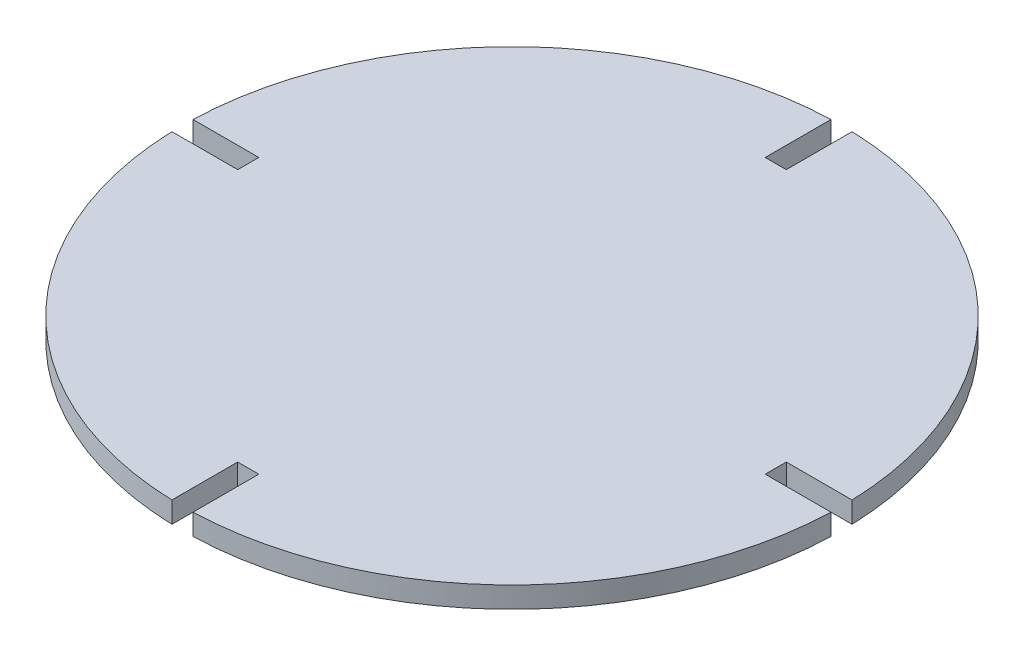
ISO-10303-21;
HEADER;
FILE_DESCRIPTION(('STEP AP214'),'2;1');
FILE_NAME('part.step','',(''),(''),'','','');
FILE_SCHEMA(('AUTOMOTIVE_DESIGN { 1 0 10303 214 1 1 1 1 }'));
ENDSEC;
DATA;
#1=APPLICATION_CONTEXT('core data for automotive mechanical design processes');
#2=APPLICATION_PROTOCOL_DEFINITION('international standard','automotive_design',2000,#1);
#3=PRODUCT_CONTEXT('',#1,'mechanical');
#4=PRODUCT('Part','Part','',(#3));
#5=PRODUCT_RELATED_PRODUCT_CATEGORY('part','',(#4));
#6=PRODUCT_DEFINITION_FORMATION('','',#4);
#7=PRODUCT_DEFINITION_CONTEXT('part definition',#1,'design');
#8=PRODUCT_DEFINITION('design','',#6,#7);
#9=PRODUCT_DEFINITION_SHAPE('','',#8);
#10=(LENGTH_UNIT() NAMED_UNIT(*) SI_UNIT(.MILLI.,.METRE.));
#11=(NAMED_UNIT(*) PLANE_ANGLE_UNIT() SI_UNIT($,.RADIAN.));
#12=(NAMED_UNIT(*) SI_UNIT($,.STERADIAN.) SOLID_ANGLE_UNIT());
#13=UNCERTAINTY_MEASURE_WITH_UNIT(LENGTH_MEASURE(1.E-05),#10,'distance_accuracy_value','');
#14=(GEOMETRIC_REPRESENTATION_CONTEXT(3) GLOBAL_UNCERTAINTY_ASSIGNED_CONTEXT((#13)) GLOBAL_UNIT_ASSIGNED_CONTEXT((#10,
#11,#12)) REPRESENTATION_CONTEXT('',''));
#15=CARTESIAN_POINT('',(0.,0.,0.));
#16=DIRECTION('',(0.,0.,1.));
#17=DIRECTION('',(1.,0.,0.));
#18=AXIS2_PLACEMENT_3D('',#15,#16,#17);
#19=CARTESIAN_POINT('',(16.0000000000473,32.,0.));
#20=DIRECTION('',(1.,0.,0.));
#21=DIRECTION('',(0.,0.,-1.));
#22=AXIS2_PLACEMENT_3D('',#19,#20,#21);
#23=PLANE('',#22);
#24=DIRECTION('',(0.,0.,1.));
#25=VECTOR('',#24,1.);
#26=CARTESIAN_POINT('',(16.0000000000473,0.,0.));
#27=LINE('',#26,#25);
#28=CARTESIAN_POINT('',(16.0000000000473,0.,399.999999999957));
#29=VERTEX_POINT('',#28);
#30=CARTESIAN_POINT('',(16.0000000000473,0.,499.743934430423));
#31=VERTEX_POINT('',#30);
#32=EDGE_CURVE('E188',#29,#31,#27,.T.);
#33=ORIENTED_EDGE('',*,*,#32,.T.);
#34=DIRECTION('',(0.,-1.,0.));
#35=VECTOR('',#34,1.);
#36=CARTESIAN_POINT('',(16.0000000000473,32.,499.743934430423));
#37=LINE('',#36,#35);
#38=CARTESIAN_POINT('',(16.0000000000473,32.,499.743934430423));
#39=VERTEX_POINT('',#38);
#40=EDGE_CURVE('E11',#39,#31,#37,.T.);
#41=ORIENTED_EDGE('',*,*,#40,.F.);
#42=DIRECTION('',(0.,0.,1.));
#43=VECTOR('',#42,1.);
#44=CARTESIAN_POINT('',(16.0000000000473,32.,0.));
#45=LINE('',#44,#43);
#46=CARTESIAN_POINT('',(16.0000000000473,32.,399.999999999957));
#47=VERTEX_POINT('',#46);
#48=EDGE_CURVE('E215',#47,#39,#45,.T.);
#49=ORIENTED_EDGE('',*,*,#48,.F.);
#50=DIRECTION('',(0.,-1.,0.));
#51=VECTOR('',#50,1.);
#52=CARTESIAN_POINT('',(16.0000000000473,32.,399.999999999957));
#53=LINE('',#52,#51);
#54=EDGE_CURVE('E183',#47,#29,#53,.T.);
#55=ORIENTED_EDGE('',*,*,#54,.T.);
#56=EDGE_LOOP('',(#33,#41,#49,#55));
#57=FACE_BOUND('',#56,.T.);
#58=ADVANCED_FACE('F42',(#57),#23,.F.);
#59=CARTESIAN_POINT('',(0.,32.,0.));
#60=DIRECTION('',(0.,-1.,0.));
#61=DIRECTION('',(0.,0.,-1.));
#62=AXIS2_PLACEMENT_3D('',#59,#60,#61);
#63=CYLINDRICAL_SURFACE('',#62,500.);
#64=CARTESIAN_POINT('',(0.,0.,0.));
#65=DIRECTION('',(0.,1.,0.));
#66=DIRECTION('',(0.,0.,1.));
#67=AXIS2_PLACEMENT_3D('',#64,#65,#66);
#68=CIRCLE('',#67,500.);
#69=CARTESIAN_POINT('',(499.743934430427,0.,15.9999999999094));
#70=VERTEX_POINT('',#69);
#71=EDGE_CURVE('E191',#31,#70,#68,.T.);
#72=ORIENTED_EDGE('',*,*,#71,.T.);
#73=DIRECTION('',(0.,-1.,0.));
#74=VECTOR('',#73,1.);
#75=CARTESIAN_POINT('',(499.743934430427,32.,15.9999999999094));
#76=LINE('',#75,#74);
#77=CARTESIAN_POINT('',(499.743934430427,32.,15.9999999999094));
#78=VERTEX_POINT('',#77);
#79=EDGE_CURVE('E50',#78,#70,#76,.T.);
#80=ORIENTED_EDGE('',*,*,#79,.F.);
#81=CARTESIAN_POINT('',(0.,32.,0.));
#82=DIRECTION('',(0.,1.,0.));
#83=DIRECTION('',(0.,0.,1.));
#84=AXIS2_PLACEMENT_3D('',#81,#82,#83);
#85=CIRCLE('',#84,500.);
#86=EDGE_CURVE('E125',#39,#78,#85,.T.);
#87=ORIENTED_EDGE('',*,*,#86,.F.);
#88=ORIENTED_EDGE('',*,*,#40,.T.);
#89=EDGE_LOOP('',(#72,#80,#87,#88));
#90=FACE_BOUND('',#89,.T.);
#91=ADVANCED_FACE('F331',(#90),#63,.T.);
#92=CARTESIAN_POINT('',(0.,32.,15.9999999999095));
#93=DIRECTION('',(0.,0.,1.));
#94=DIRECTION('',(1.,0.,0.));
#95=AXIS2_PLACEMENT_3D('',#92,#93,#94);
#96=PLANE('',#95);
#97=DIRECTION('',(-1.,0.,0.));
#98=VECTOR('',#97,1.);
#99=CARTESIAN_POINT('',(0.,0.,15.9999999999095));
#100=LINE('',#99,#98);
#101=CARTESIAN_POINT('',(400.000000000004,0.,15.9999999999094));
#102=VERTEX_POINT('',#101);
#103=EDGE_CURVE('E193',#70,#102,#100,.T.);
#104=ORIENTED_EDGE('',*,*,#103,.T.);
#105=DIRECTION('',(0.,-1.,0.));
#106=VECTOR('',#105,1.);
#107=CARTESIAN_POINT('',(400.000000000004,32.,15.9999999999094));
#108=LINE('',#107,#106);
#109=CARTESIAN_POINT('',(400.000000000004,32.,15.9999999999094));
#110=VERTEX_POINT('',#109);
#111=EDGE_CURVE('E246',#110,#102,#108,.T.);
#112=ORIENTED_EDGE('',*,*,#111,.F.);
#113=DIRECTION('',(-1.,0.,0.));
#114=VECTOR('',#113,1.);
#115=CARTESIAN_POINT('',(0.,32.,15.9999999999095));
#116=LINE('',#115,#114);
#117=EDGE_CURVE('E254',#78,#110,#116,.T.);
#118=ORIENTED_EDGE('',*,*,#117,.F.);
#119=ORIENTED_EDGE('',*,*,#79,.T.);
#120=EDGE_LOOP('',(#104,#112,#118,#119));
#121=FACE_BOUND('',#120,.T.);
#122=ADVANCED_FACE('F252',(#121),#96,.F.);
#123=CARTESIAN_POINT('',(400.000000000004,32.,0.));
#124=DIRECTION('',(-1.,0.,0.));
#125=DIRECTION('',(0.,0.,1.));
#126=AXIS2_PLACEMENT_3D('',#123,#124,#125);
#127=PLANE('',#126);
#128=DIRECTION('',(0.,0.,-1.));
#129=VECTOR('',#128,1.);
#130=CARTESIAN_POINT('',(400.000000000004,0.,0.));
#131=LINE('',#130,#129);
#132=CARTESIAN_POINT('',(400.000000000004,0.,-16.0000000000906));
#133=VERTEX_POINT('',#132);
#134=EDGE_CURVE('E196',#102,#133,#131,.T.);
#135=ORIENTED_EDGE('',*,*,#134,.T.);
#136=DIRECTION('',(0.,-1.,0.));
#137=VECTOR('',#136,1.);
#138=CARTESIAN_POINT('',(400.000000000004,32.,-16.0000000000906));
#139=LINE('',#138,#137);
#140=CARTESIAN_POINT('',(400.000000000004,32.,-16.0000000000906));
#141=VERTEX_POINT('',#140);
#142=EDGE_CURVE('E243',#141,#133,#139,.T.);
#143=ORIENTED_EDGE('',*,*,#142,.F.);
#144=DIRECTION('',(0.,0.,-1.));
#145=VECTOR('',#144,1.);
#146=CARTESIAN_POINT('',(400.000000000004,32.,0.));
#147=LINE('',#146,#145);
#148=EDGE_CURVE('E272',#110,#141,#147,.T.);
#149=ORIENTED_EDGE('',*,*,#148,.F.);
#150=ORIENTED_EDGE('',*,*,#111,.T.);
#151=EDGE_LOOP('',(#135,#143,#149,#150));
#152=FACE_BOUND('',#151,.T.);
#153=ADVANCED_FACE('F263',(#152),#127,.F.);
#154=CARTESIAN_POINT('',(0.,32.,-16.0000000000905));
#155=DIRECTION('',(0.,0.,-1.));
#156=DIRECTION('',(-1.,0.,0.));
#157=AXIS2_PLACEMENT_3D('',#154,#155,#156);
#158=PLANE('',#157);
#159=DIRECTION('',(1.,0.,0.));
#160=VECTOR('',#159,1.);
#161=CARTESIAN_POINT('',(0.,0.,-16.0000000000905));
#162=LINE('',#161,#160);
#163=CARTESIAN_POINT('',(499.743934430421,0.,-16.0000000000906));
#164=VERTEX_POINT('',#163);
#165=EDGE_CURVE('E198',#133,#164,#162,.T.);
#166=ORIENTED_EDGE('',*,*,#165,.T.);
#167=DIRECTION('',(0.,-1.,0.));
#168=VECTOR('',#167,1.);
#169=CARTESIAN_POINT('',(499.743934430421,32.,-16.0000000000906));
#170=LINE('',#169,#168);
#171=CARTESIAN_POINT('',(499.743934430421,32.,-16.0000000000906));
#172=VERTEX_POINT('',#171);
#173=EDGE_CURVE('E240',#172,#164,#170,.T.);
#174=ORIENTED_EDGE('',*,*,#173,.F.);
#175=DIRECTION('',(1.,0.,0.));
#176=VECTOR('',#175,1.);
#177=CARTESIAN_POINT('',(0.,32.,-16.0000000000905));
#178=LINE('',#177,#176);
#179=EDGE_CURVE('E269',#141,#172,#178,.T.);
#180=ORIENTED_EDGE('',*,*,#179,.F.);
#181=ORIENTED_EDGE('',*,*,#142,.T.);
#182=EDGE_LOOP('',(#166,#174,#180,#181));
#183=FACE_BOUND('',#182,.T.);
#184=ADVANCED_FACE('F267',(#183),#158,.F.);
#185=CARTESIAN_POINT('',(15.9999999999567,0.,-499.743934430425));
#186=VERTEX_POINT('',#185);
#187=EDGE_CURVE('E194',#164,#186,#68,.T.);
#188=ORIENTED_EDGE('',*,*,#187,.T.);
#189=DIRECTION('',(0.,-1.,0.));
#190=VECTOR('',#189,1.);
#191=CARTESIAN_POINT('',(15.9999999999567,32.,-499.743934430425));
#192=LINE('',#191,#190);
#193=CARTESIAN_POINT('',(15.9999999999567,32.,-499.743934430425));
#194=VERTEX_POINT('',#193);
#195=EDGE_CURVE('E237',#194,#186,#192,.T.);
#196=ORIENTED_EDGE('',*,*,#195,.F.);
#197=EDGE_CURVE('E271',#172,#194,#85,.T.);
#198=ORIENTED_EDGE('',*,*,#197,.F.);
#199=ORIENTED_EDGE('',*,*,#173,.T.);
#200=EDGE_LOOP('',(#188,#196,#198,#199));
#201=FACE_BOUND('',#200,.T.);
#202=ADVANCED_FACE('F300',(#201),#63,.T.);
#203=CARTESIAN_POINT('',(15.9999999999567,32.,0.));
#204=DIRECTION('',(1.,0.,0.));
#205=DIRECTION('',(0.,0.,-1.));
#206=AXIS2_PLACEMENT_3D('',#203,#204,#205);
#207=PLANE('',#206);
#208=DIRECTION('',(0.,0.,1.));
#209=VECTOR('',#208,1.);
#210=CARTESIAN_POINT('',(15.9999999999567,0.,0.));
#211=LINE('',#210,#209);
#212=CARTESIAN_POINT('',(15.9999999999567,0.,-400.000000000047));
#213=VERTEX_POINT('',#212);
#214=EDGE_CURVE('E200',#186,#213,#211,.T.);
#215=ORIENTED_EDGE('',*,*,#214,.T.);
#216=DIRECTION('',(0.,-1.,0.));
#217=VECTOR('',#216,1.);
#218=CARTESIAN_POINT('',(15.9999999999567,32.,-400.000000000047));
#219=LINE('',#218,#217);
#220=CARTESIAN_POINT('',(15.9999999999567,32.,-400.000000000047));
#221=VERTEX_POINT('',#220);
#222=EDGE_CURVE('E234',#221,#213,#219,.T.);
#223=ORIENTED_EDGE('',*,*,#222,.F.);
#224=DIRECTION('',(0.,0.,1.));
#225=VECTOR('',#224,1.);
#226=CARTESIAN_POINT('',(15.9999999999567,32.,0.));
#227=LINE('',#226,#225);
#228=EDGE_CURVE('E274',#194,#221,#227,.T.);
#229=ORIENTED_EDGE('',*,*,#228,.F.);
#230=ORIENTED_EDGE('',*,*,#195,.T.);
#231=EDGE_LOOP('',(#215,#223,#229,#230));
#232=FACE_BOUND('',#231,.T.);
#233=ADVANCED_FACE('F304',(#232),#207,.F.);
#234=CARTESIAN_POINT('',(0.,32.,-400.000000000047));
#235=DIRECTION('',(0.,0.,1.));
#236=DIRECTION('',(1.,0.,0.));
#237=AXIS2_PLACEMENT_3D('',#234,#235,#236);
#238=PLANE('',#237);
#239=DIRECTION('',(-1.,0.,0.));
#240=VECTOR('',#239,1.);
#241=CARTESIAN_POINT('',(0.,0.,-400.000000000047));
#242=LINE('',#241,#240);
#243=CARTESIAN_POINT('',(-16.0000000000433,0.,-400.000000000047));
#244=VERTEX_POINT('',#243);
#245=EDGE_CURVE('E202',#213,#244,#242,.T.);
#246=ORIENTED_EDGE('',*,*,#245,.T.);
#247=DIRECTION('',(0.,-1.,0.));
#248=VECTOR('',#247,1.);
#249=CARTESIAN_POINT('',(-16.0000000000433,32.,-400.000000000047));
#250=LINE('',#249,#248);
#251=CARTESIAN_POINT('',(-16.0000000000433,32.,-400.000000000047));
#252=VERTEX_POINT('',#251);
#253=EDGE_CURVE('E231',#252,#244,#250,.T.);
#254=ORIENTED_EDGE('',*,*,#253,.F.);
#255=DIRECTION('',(-1.,0.,0.));
#256=VECTOR('',#255,1.);
#257=CARTESIAN_POINT('',(0.,32.,-400.000000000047));
#258=LINE('',#257,#256);
#259=EDGE_CURVE('E279',#221,#252,#258,.T.);
#260=ORIENTED_EDGE('',*,*,#259,.F.);
#261=ORIENTED_EDGE('',*,*,#222,.T.);
#262=EDGE_LOOP('',(#246,#254,#260,#261));
#263=FACE_BOUND('',#262,.T.);
#264=ADVANCED_FACE('F310',(#263),#238,.F.);
#265=CARTESIAN_POINT('',(-16.0000000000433,32.,0.));
#266=DIRECTION('',(-1.,0.,0.));
#267=DIRECTION('',(0.,0.,1.));
#268=AXIS2_PLACEMENT_3D('',#265,#266,#267);
#269=PLANE('',#268);
#270=DIRECTION('',(0.,0.,-1.));
#271=VECTOR('',#270,1.);
#272=CARTESIAN_POINT('',(-16.0000000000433,0.,0.));
#273=LINE('',#272,#271);
#274=CARTESIAN_POINT('',(-16.0000000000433,0.,-499.743934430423));
#275=VERTEX_POINT('',#274);
#276=EDGE_CURVE('E204',#244,#275,#273,.T.);
#277=ORIENTED_EDGE('',*,*,#276,.T.);
#278=DIRECTION('',(0.,-1.,0.));
#279=VECTOR('',#278,1.);
#280=CARTESIAN_POINT('',(-16.0000000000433,32.,-499.743934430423));
#281=LINE('',#280,#279);
#282=CARTESIAN_POINT('',(-16.0000000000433,32.,-499.743934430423));
#283=VERTEX_POINT('',#282);
#284=EDGE_CURVE('E228',#283,#275,#281,.T.);
#285=ORIENTED_EDGE('',*,*,#284,.F.);
#286=DIRECTION('',(0.,0.,-1.));
#287=VECTOR('',#286,1.);
#288=CARTESIAN_POINT('',(-16.0000000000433,32.,0.));
#289=LINE('',#288,#287);
#290=EDGE_CURVE('E281',#252,#283,#289,.T.);
#291=ORIENTED_EDGE('',*,*,#290,.F.);
#292=ORIENTED_EDGE('',*,*,#253,.T.);
#293=EDGE_LOOP('',(#277,#285,#291,#292));
#294=FACE_BOUND('',#293,.T.);
#295=ADVANCED_FACE('F314',(#294),#269,.F.);
#296=CARTESIAN_POINT('',(-499.743934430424,0.,-16.));
#297=VERTEX_POINT('',#296);
#298=EDGE_CURVE('E206',#275,#297,#68,.T.);
#299=ORIENTED_EDGE('',*,*,#298,.T.);
#300=DIRECTION('',(0.,-1.,0.));
#301=VECTOR('',#300,1.);
#302=CARTESIAN_POINT('',(-499.743934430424,32.,-16.));
#303=LINE('',#302,#301);
#304=CARTESIAN_POINT('',(-499.743934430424,32.,-16.));
#305=VERTEX_POINT('',#304);
#306=EDGE_CURVE('E225',#305,#297,#303,.T.);
#307=ORIENTED_EDGE('',*,*,#306,.F.);
#308=EDGE_CURVE('E173',#283,#305,#85,.T.);
#309=ORIENTED_EDGE('',*,*,#308,.F.);
#310=ORIENTED_EDGE('',*,*,#284,.T.);
#311=EDGE_LOOP('',(#299,#307,#309,#310));
#312=FACE_BOUND('',#311,.T.);
#313=ADVANCED_FACE('F317',(#312),#63,.T.);
#314=CARTESIAN_POINT('',(0.,32.,-16.));
#315=DIRECTION('',(0.,0.,-1.));
#316=DIRECTION('',(-1.,0.,0.));
#317=AXIS2_PLACEMENT_3D('',#314,#315,#316);
#318=PLANE('',#317);
#319=DIRECTION('',(1.,0.,0.));
#320=VECTOR('',#319,1.);
#321=CARTESIAN_POINT('',(0.,0.,-16.));
#322=LINE('',#321,#320);
#323=CARTESIAN_POINT('',(-400.,0.,-16.));
#324=VERTEX_POINT('',#323);
#325=EDGE_CURVE('E207',#297,#324,#322,.T.);
#326=ORIENTED_EDGE('',*,*,#325,.T.);
#327=DIRECTION('',(0.,-1.,0.));
#328=VECTOR('',#327,1.);
#329=CARTESIAN_POINT('',(-400.,32.,-16.));
#330=LINE('',#329,#328);
#331=CARTESIAN_POINT('',(-400.,32.,-16.));
#332=VERTEX_POINT('',#331);
#333=EDGE_CURVE('E222',#332,#324,#330,.T.);
#334=ORIENTED_EDGE('',*,*,#333,.F.);
#335=DIRECTION('',(1.,0.,0.));
#336=VECTOR('',#335,1.);
#337=CARTESIAN_POINT('',(0.,32.,-16.));
#338=LINE('',#337,#336);
#339=EDGE_CURVE('E283',#305,#332,#338,.T.);
#340=ORIENTED_EDGE('',*,*,#339,.F.);
#341=ORIENTED_EDGE('',*,*,#306,.T.);
#342=EDGE_LOOP('',(#326,#334,#340,#341));
#343=FACE_BOUND('',#342,.T.);
#344=ADVANCED_FACE('F320',(#343),#318,.F.);
#345=CARTESIAN_POINT('',(-400.,32.,0.));
#346=DIRECTION('',(1.,0.,0.));
#347=DIRECTION('',(0.,0.,-1.));
#348=AXIS2_PLACEMENT_3D('',#345,#346,#347);
#349=PLANE('',#348);
#350=DIRECTION('',(0.,0.,1.));
#351=VECTOR('',#350,1.);
#352=CARTESIAN_POINT('',(-400.,0.,0.));
#353=LINE('',#352,#351);
#354=CARTESIAN_POINT('',(-400.,0.,16.));
#355=VERTEX_POINT('',#354);
#356=EDGE_CURVE('E209',#324,#355,#353,.T.);
#357=ORIENTED_EDGE('',*,*,#356,.T.);
#358=DIRECTION('',(0.,-1.,0.));
#359=VECTOR('',#358,1.);
#360=CARTESIAN_POINT('',(-400.,32.,16.));
#361=LINE('',#360,#359);
#362=CARTESIAN_POINT('',(-400.,32.,16.));
#363=VERTEX_POINT('',#362);
#364=EDGE_CURVE('E219',#363,#355,#361,.T.);
#365=ORIENTED_EDGE('',*,*,#364,.F.);
#366=DIRECTION('',(0.,0.,1.));
#367=VECTOR('',#366,1.);
#368=CARTESIAN_POINT('',(-400.,32.,0.));
#369=LINE('',#368,#367);
#370=EDGE_CURVE('E284',#332,#363,#369,.T.);
#371=ORIENTED_EDGE('',*,*,#370,.F.);
#372=ORIENTED_EDGE('',*,*,#333,.T.);
#373=EDGE_LOOP('',(#357,#365,#371,#372));
#374=FACE_BOUND('',#373,.T.);
#375=ADVANCED_FACE('F290',(#374),#349,.F.);
#376=CARTESIAN_POINT('',(0.,32.,16.));
#377=DIRECTION('',(0.,0.,1.));
#378=DIRECTION('',(1.,0.,0.));
#379=AXIS2_PLACEMENT_3D('',#376,#377,#378);
#380=PLANE('',#379);
#381=DIRECTION('',(-1.,0.,0.));
#382=VECTOR('',#381,1.);
#383=CARTESIAN_POINT('',(0.,0.,16.));
#384=LINE('',#383,#382);
#385=CARTESIAN_POINT('',(-499.743934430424,0.,16.));
#386=VERTEX_POINT('',#385);
#387=EDGE_CURVE('E211',#355,#386,#384,.T.);
#388=ORIENTED_EDGE('',*,*,#387,.T.);
#389=DIRECTION('',(0.,-1.,0.));
#390=VECTOR('',#389,1.);
#391=CARTESIAN_POINT('',(-499.743934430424,32.,16.));
#392=LINE('',#391,#390);
#393=CARTESIAN_POINT('',(-499.743934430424,32.,16.));
#394=VERTEX_POINT('',#393);
#395=EDGE_CURVE('E178',#394,#386,#392,.T.);
#396=ORIENTED_EDGE('',*,*,#395,.F.);
#397=DIRECTION('',(-1.,0.,0.));
#398=VECTOR('',#397,1.);
#399=CARTESIAN_POINT('',(0.,32.,16.));
#400=LINE('',#399,#398);
#401=EDGE_CURVE('E168',#363,#394,#400,.T.);
#402=ORIENTED_EDGE('',*,*,#401,.F.);
#403=ORIENTED_EDGE('',*,*,#364,.T.);
#404=EDGE_LOOP('',(#388,#396,#402,#403));
#405=FACE_BOUND('',#404,.T.);
#406=ADVANCED_FACE('F294',(#405),#380,.F.);
#407=CARTESIAN_POINT('',(-15.9999999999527,0.,499.743934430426));
#408=VERTEX_POINT('',#407);
#409=EDGE_CURVE('E177',#386,#408,#68,.T.);
#410=ORIENTED_EDGE('',*,*,#409,.T.);
#411=DIRECTION('',(0.,-1.,0.));
#412=VECTOR('',#411,1.);
#413=CARTESIAN_POINT('',(-15.9999999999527,32.,499.743934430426));
#414=LINE('',#413,#412);
#415=CARTESIAN_POINT('',(-15.9999999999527,32.,499.743934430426));
#416=VERTEX_POINT('',#415);
#417=EDGE_CURVE('E174',#416,#408,#414,.T.);
#418=ORIENTED_EDGE('',*,*,#417,.F.);
#419=EDGE_CURVE('E162',#394,#416,#85,.T.);
#420=ORIENTED_EDGE('',*,*,#419,.F.);
#421=ORIENTED_EDGE('',*,*,#395,.T.);
#422=EDGE_LOOP('',(#410,#418,#420,#421));
#423=FACE_BOUND('',#422,.T.);
#424=ADVANCED_FACE('F175',(#423),#63,.T.);
#425=CARTESIAN_POINT('',(-15.9999999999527,32.,0.));
#426=DIRECTION('',(-1.,0.,0.));
#427=DIRECTION('',(0.,0.,1.));
#428=AXIS2_PLACEMENT_3D('',#425,#426,#427);
#429=PLANE('',#428);
#430=DIRECTION('',(0.,0.,-1.));
#431=VECTOR('',#430,1.);
#432=CARTESIAN_POINT('',(-15.9999999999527,0.,0.));
#433=LINE('',#432,#431);
#434=CARTESIAN_POINT('',(-15.9999999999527,0.,399.999999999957));
#435=VERTEX_POINT('',#434);
#436=EDGE_CURVE('E111',#408,#435,#433,.T.);
#437=ORIENTED_EDGE('',*,*,#436,.T.);
#438=DIRECTION('',(0.,-1.,0.));
#439=VECTOR('',#438,1.);
#440=CARTESIAN_POINT('',(-15.9999999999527,32.,399.999999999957));
#441=LINE('',#440,#439);
#442=CARTESIAN_POINT('',(-15.9999999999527,32.,399.999999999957));
#443=VERTEX_POINT('',#442);
#444=EDGE_CURVE('E179',#443,#435,#441,.T.);
#445=ORIENTED_EDGE('',*,*,#444,.F.);
#446=DIRECTION('',(0.,0.,-1.));
#447=VECTOR('',#446,1.);
#448=CARTESIAN_POINT('',(-15.9999999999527,32.,0.));
#449=LINE('',#448,#447);
#450=EDGE_CURVE('E166',#416,#443,#449,.T.);
#451=ORIENTED_EDGE('',*,*,#450,.F.);
#452=ORIENTED_EDGE('',*,*,#417,.T.);
#453=EDGE_LOOP('',(#437,#445,#451,#452));
#454=FACE_BOUND('',#453,.T.);
#455=ADVANCED_FACE('F181',(#454),#429,.F.);
#456=CARTESIAN_POINT('',(0.,32.,399.999999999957));
#457=DIRECTION('',(0.,0.,-1.));
#458=DIRECTION('',(-1.,0.,0.));
#459=AXIS2_PLACEMENT_3D('',#456,#457,#458);
#460=PLANE('',#459);
#461=DIRECTION('',(1.,0.,0.));
#462=VECTOR('',#461,1.);
#463=CARTESIAN_POINT('',(0.,0.,399.999999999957));
#464=LINE('',#463,#462);
#465=EDGE_CURVE('E117',#435,#29,#464,.T.);
#466=ORIENTED_EDGE('',*,*,#465,.T.);
#467=ORIENTED_EDGE('',*,*,#54,.F.);
#468=DIRECTION('',(1.,0.,0.));
#469=VECTOR('',#468,1.);
#470=CARTESIAN_POINT('',(0.,32.,399.999999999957));
#471=LINE('',#470,#469);
#472=EDGE_CURVE('E58',#443,#47,#471,.T.);
#473=ORIENTED_EDGE('',*,*,#472,.F.);
#474=ORIENTED_EDGE('',*,*,#444,.T.);
#475=EDGE_LOOP('',(#466,#467,#473,#474));
#476=FACE_BOUND('',#475,.T.);
#477=ADVANCED_FACE('F338',(#476),#460,.F.);
#478=CARTESIAN_POINT('',(0.,32.,0.));
#479=DIRECTION('',(0.,1.,0.));
#480=DIRECTION('',(0.,0.,1.));
#481=AXIS2_PLACEMENT_3D('',#478,#479,#480);
#482=PLANE('',#481);
#483=ORIENTED_EDGE('',*,*,#48,.T.);
#484=ORIENTED_EDGE('',*,*,#86,.T.);
#485=ORIENTED_EDGE('',*,*,#117,.T.);
#486=ORIENTED_EDGE('',*,*,#148,.T.);
#487=ORIENTED_EDGE('',*,*,#179,.T.);
#488=ORIENTED_EDGE('',*,*,#197,.T.);
#489=ORIENTED_EDGE('',*,*,#228,.T.);
#490=ORIENTED_EDGE('',*,*,#259,.T.);
#491=ORIENTED_EDGE('',*,*,#290,.T.);
#492=ORIENTED_EDGE('',*,*,#308,.T.);
#493=ORIENTED_EDGE('',*,*,#339,.T.);
#494=ORIENTED_EDGE('',*,*,#370,.T.);
#495=ORIENTED_EDGE('',*,*,#401,.T.);
#496=ORIENTED_EDGE('',*,*,#419,.T.);
#497=ORIENTED_EDGE('',*,*,#450,.T.);
#498=ORIENTED_EDGE('',*,*,#472,.T.);
#499=EDGE_LOOP('',(#483,#484,#485,#486,#487,#488,#489,#490,#491,#492,#493,#494,#495,#496,#497,#498));
#500=FACE_BOUND('',#499,.T.);
#501=ADVANCED_FACE('F164',(#500),#482,.T.);
#502=CARTESIAN_POINT('',(0.,0.,0.));
#503=DIRECTION('',(0.,1.,0.));
#504=DIRECTION('',(0.,0.,1.));
#505=AXIS2_PLACEMENT_3D('',#502,#503,#504);
#506=PLANE('',#505);
#507=ORIENTED_EDGE('',*,*,#32,.F.);
#508=ORIENTED_EDGE('',*,*,#465,.F.);
#509=ORIENTED_EDGE('',*,*,#436,.F.);
#510=ORIENTED_EDGE('',*,*,#409,.F.);
#511=ORIENTED_EDGE('',*,*,#387,.F.);
#512=ORIENTED_EDGE('',*,*,#356,.F.);
#513=ORIENTED_EDGE('',*,*,#325,.F.);
#514=ORIENTED_EDGE('',*,*,#298,.F.);
#515=ORIENTED_EDGE('',*,*,#276,.F.);
#516=ORIENTED_EDGE('',*,*,#245,.F.);
#517=ORIENTED_EDGE('',*,*,#214,.F.);
#518=ORIENTED_EDGE('',*,*,#187,.F.);
#519=ORIENTED_EDGE('',*,*,#165,.F.);
#520=ORIENTED_EDGE('',*,*,#134,.F.);
#521=ORIENTED_EDGE('',*,*,#103,.F.);
#522=ORIENTED_EDGE('',*,*,#71,.F.);
#523=EDGE_LOOP('',(#507,#508,#509,#510,#511,#512,#513,#514,#515,#516,#517,#518,#519,#520,#521,#522));
#524=FACE_BOUND('',#523,.T.);
#525=ADVANCED_FACE('F258',(#524),#506,.F.);
#526=CLOSED_SHELL('',(#58,#91,#122,#153,#184,#202,#233,#264,#295,#313,#344,#375,#406,#424,#455,
#477,#501,#525));
#527=MANIFOLD_SOLID_BREP('B2',#526);
#528=ADVANCED_BREP_SHAPE_REPRESENTATION('',(#18,#527),#14);
#529=SHAPE_DEFINITION_REPRESENTATION(#9,#528);
ENDSEC;
END-ISO-10303-21;
